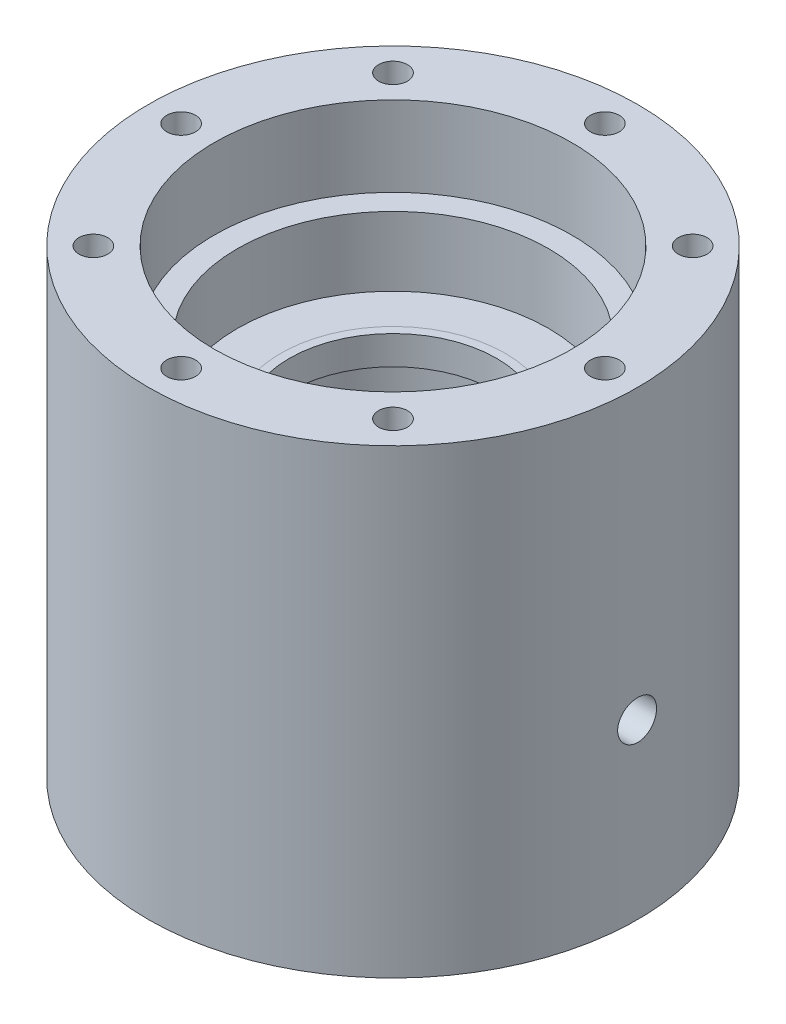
ISO-10303-21;
HEADER;
FILE_DESCRIPTION(('STEP AP214'),'2;1');
FILE_NAME('part.step','',(''),(''),'','','');
FILE_SCHEMA(('AUTOMOTIVE_DESIGN { 1 0 10303 214 1 1 1 1 }'));
ENDSEC;
DATA;
#1=APPLICATION_CONTEXT('core data for automotive mechanical design processes');
#2=APPLICATION_PROTOCOL_DEFINITION('international standard','automotive_design',2000,#1);
#3=PRODUCT_CONTEXT('',#1,'mechanical');
#4=PRODUCT('Part','Part','',(#3));
#5=PRODUCT_RELATED_PRODUCT_CATEGORY('part','',(#4));
#6=PRODUCT_DEFINITION_FORMATION('','',#4);
#7=PRODUCT_DEFINITION_CONTEXT('part definition',#1,'design');
#8=PRODUCT_DEFINITION('design','',#6,#7);
#9=PRODUCT_DEFINITION_SHAPE('','',#8);
#10=(LENGTH_UNIT() NAMED_UNIT(*) SI_UNIT(.MILLI.,.METRE.));
#11=(NAMED_UNIT(*) PLANE_ANGLE_UNIT() SI_UNIT($,.RADIAN.));
#12=(NAMED_UNIT(*) SI_UNIT($,.STERADIAN.) SOLID_ANGLE_UNIT());
#13=UNCERTAINTY_MEASURE_WITH_UNIT(LENGTH_MEASURE(1.E-05),#10,'distance_accuracy_value','');
#14=(GEOMETRIC_REPRESENTATION_CONTEXT(3) GLOBAL_UNCERTAINTY_ASSIGNED_CONTEXT((#13)) GLOBAL_UNIT_ASSIGNED_CONTEXT((#10,
#11,#12)) REPRESENTATION_CONTEXT('',''));
#15=CARTESIAN_POINT('',(0.,0.,0.));
#16=DIRECTION('',(0.,0.,1.));
#17=DIRECTION('',(1.,0.,0.));
#18=AXIS2_PLACEMENT_3D('',#15,#16,#17);
#19=CARTESIAN_POINT('',(0.,49.1,0.));
#20=DIRECTION('',(0.,1.,0.));
#21=DIRECTION('',(0.,0.,1.));
#22=AXIS2_PLACEMENT_3D('',#19,#20,#21);
#23=CYLINDRICAL_SURFACE('',#22,19.5);
#24=CARTESIAN_POINT('',(0.,49.1,0.));
#25=DIRECTION('',(0.,1.,0.));
#26=DIRECTION('',(0.,0.,1.));
#27=AXIS2_PLACEMENT_3D('',#24,#25,#26);
#28=CIRCLE('',#27,19.5);
#29=CARTESIAN_POINT('',(0.,49.1,19.5));
#30=VERTEX_POINT('',#29);
#31=EDGE_CURVE('E11',#30,#30,#28,.T.);
#32=ORIENTED_EDGE('',*,*,#31,.T.);
#33=EDGE_LOOP('',(#32));
#34=FACE_BOUND('',#33,.T.);
#35=CARTESIAN_POINT('',(0.,54.1,0.));
#36=DIRECTION('',(0.,1.,0.));
#37=DIRECTION('',(0.,0.,1.));
#38=AXIS2_PLACEMENT_3D('',#35,#36,#37);
#39=CIRCLE('',#38,19.5);
#40=CARTESIAN_POINT('',(0.,54.1,19.5));
#41=VERTEX_POINT('',#40);
#42=EDGE_CURVE('E44',#41,#41,#39,.T.);
#43=ORIENTED_EDGE('',*,*,#42,.F.);
#44=EDGE_LOOP('',(#43));
#45=FACE_BOUND('',#44,.T.);
#46=ADVANCED_FACE('F41',(#34,#45),#23,.T.);
#47=CARTESIAN_POINT('',(0.,49.1,0.));
#48=DIRECTION('',(0.,1.,0.));
#49=DIRECTION('',(0.,0.,1.));
#50=AXIS2_PLACEMENT_3D('',#47,#48,#49);
#51=PLANE('',#50);
#52=CARTESIAN_POINT('',(0.,49.1,0.));
#53=DIRECTION('',(0.,1.,0.));
#54=DIRECTION('',(0.,0.,1.));
#55=AXIS2_PLACEMENT_3D('',#52,#53,#54);
#56=CIRCLE('',#55,18.);
#57=CARTESIAN_POINT('',(0.,49.1,18.));
#58=VERTEX_POINT('',#57);
#59=EDGE_CURVE('E51',#58,#58,#56,.T.);
#60=ORIENTED_EDGE('',*,*,#59,.T.);
#61=EDGE_LOOP('',(#60));
#62=FACE_BOUND('',#61,.T.);
#63=ORIENTED_EDGE('',*,*,#31,.F.);
#64=EDGE_LOOP('',(#63));
#65=FACE_BOUND('',#64,.T.);
#66=ADVANCED_FACE('F59',(#62,#65),#51,.F.);
#67=CARTESIAN_POINT('',(0.,54.1,0.));
#68=DIRECTION('',(0.,1.,0.));
#69=DIRECTION('',(0.,0.,1.));
#70=AXIS2_PLACEMENT_3D('',#67,#68,#69);
#71=PLANE('',#70);
#72=CARTESIAN_POINT('',(0.,54.1,0.));
#73=DIRECTION('',(0.,1.,0.));
#74=DIRECTION('',(0.,0.,1.));
#75=AXIS2_PLACEMENT_3D('',#72,#73,#74);
#76=CIRCLE('',#75,18.);
#77=CARTESIAN_POINT('',(0.,54.1,18.));
#78=VERTEX_POINT('',#77);
#79=EDGE_CURVE('E53',#78,#78,#76,.T.);
#80=ORIENTED_EDGE('',*,*,#79,.F.);
#81=EDGE_LOOP('',(#80));
#82=FACE_BOUND('',#81,.T.);
#83=ORIENTED_EDGE('',*,*,#42,.T.);
#84=EDGE_LOOP('',(#83));
#85=FACE_BOUND('',#84,.T.);
#86=ADVANCED_FACE('F65',(#82,#85),#71,.T.);
#87=CARTESIAN_POINT('',(0.,49.1,0.));
#88=DIRECTION('',(0.,1.,0.));
#89=DIRECTION('',(0.,0.,1.));
#90=AXIS2_PLACEMENT_3D('',#87,#88,#89);
#91=CYLINDRICAL_SURFACE('',#90,18.);
#92=ORIENTED_EDGE('',*,*,#59,.F.);
#93=EDGE_LOOP('',(#92));
#94=FACE_BOUND('',#93,.T.);
#95=ORIENTED_EDGE('',*,*,#79,.T.);
#96=EDGE_LOOP('',(#95));
#97=FACE_BOUND('',#96,.T.);
#98=ADVANCED_FACE('F62',(#94,#97),#91,.F.);
#99=CLOSED_SHELL('',(#46,#66,#86,#98));
#100=MANIFOLD_SOLID_BREP('B2',#99);
#101=CARTESIAN_POINT('',(0.,80.,0.));
#102=DIRECTION('',(0.,-1.,0.));
#103=DIRECTION('',(0.,0.,-1.));
#104=AXIS2_PLACEMENT_3D('',#101,#102,#103);
#105=CYLINDRICAL_SURFACE('',#104,19.5);
#106=CARTESIAN_POINT('',(19.2057120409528,30.,-3.375));
#107=CARTESIAN_POINT('',(19.2057155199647,30.1880456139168,-3.37499253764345));
#108=CARTESIAN_POINT('',(19.208503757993,30.3761912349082,-3.35923067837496));
#109=CARTESIAN_POINT('',(19.219344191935,30.7471957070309,-3.29663153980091));
#110=CARTESIAN_POINT('',(19.2274011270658,30.930049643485,-3.24976628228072));
#111=CARTESIAN_POINT('',(19.2478397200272,31.2850481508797,-3.12642708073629));
#112=CARTESIAN_POINT('',(19.2602176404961,31.4572018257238,-3.04997871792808));
#113=CARTESIAN_POINT('',(19.2878991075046,31.7862230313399,-2.86970836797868));
#114=CARTESIAN_POINT('',(19.3032023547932,31.9430921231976,-2.76588918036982));
#115=CARTESIAN_POINT('',(19.3351917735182,32.2387739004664,-2.53264832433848));
#116=CARTESIAN_POINT('',(19.3518897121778,32.3774006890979,-2.40299257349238));
#117=CARTESIAN_POINT('',(19.3846827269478,32.631046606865,-2.1222649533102));
#118=CARTESIAN_POINT('',(19.4007777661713,32.7460642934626,-1.97119177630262));
#119=CARTESIAN_POINT('',(19.4306765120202,32.949929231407,-1.65070816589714));
#120=CARTESIAN_POINT('',(19.4444647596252,33.0386027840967,-1.48118567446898));
#121=CARTESIAN_POINT('',(19.4680651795,33.1861451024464,-1.12937245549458));
#122=CARTESIAN_POINT('',(19.4778776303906,33.2450159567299,-0.947082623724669));
#123=CARTESIAN_POINT('',(19.4923377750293,33.3307112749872,-0.576831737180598));
#124=CARTESIAN_POINT('',(19.4970358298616,33.3578484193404,-0.38894505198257));
#125=CARTESIAN_POINT('',(19.5009110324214,33.3802788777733,-0.0112305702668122));
#126=CARTESIAN_POINT('',(19.5000885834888,33.3755745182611,0.178597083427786));
#127=CARTESIAN_POINT('',(19.493055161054,33.3346981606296,0.552665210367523));
#128=CARTESIAN_POINT('',(19.4869018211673,33.2988627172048,0.736943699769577));
#129=CARTESIAN_POINT('',(19.4699623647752,33.1972720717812,1.09683185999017));
#130=CARTESIAN_POINT('',(19.4591760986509,33.1315159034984,1.27244125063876));
#131=CARTESIAN_POINT('',(19.4340851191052,32.9716200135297,1.61099989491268));
#132=CARTESIAN_POINT('',(19.4197634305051,32.8773428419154,1.77388292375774));
#133=CARTESIAN_POINT('',(19.3891906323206,32.6631819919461,2.08164357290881));
#134=CARTESIAN_POINT('',(19.3729393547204,32.5432960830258,2.22651962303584));
#135=CARTESIAN_POINT('',(19.3400617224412,32.279457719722,2.49614399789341));
#136=CARTESIAN_POINT('',(19.3234332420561,32.1352110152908,2.62060429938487));
#137=CARTESIAN_POINT('',(19.2918801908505,31.8277337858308,2.84360364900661));
#138=CARTESIAN_POINT('',(19.2769556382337,31.6645030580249,2.9421424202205));
#139=CARTESIAN_POINT('',(19.2504985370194,31.323343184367,3.11056564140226));
#140=CARTESIAN_POINT('',(19.238970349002,31.1453955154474,3.18041329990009));
#141=CARTESIAN_POINT('',(19.2206816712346,30.7800481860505,3.2891436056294));
#142=CARTESIAN_POINT('',(19.2139207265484,30.5926494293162,3.32802920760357));
#143=CARTESIAN_POINT('',(19.2060206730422,30.2163024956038,3.37332160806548));
#144=CARTESIAN_POINT('',(19.2048103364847,30.0274052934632,3.38013993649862));
#145=CARTESIAN_POINT('',(19.2079585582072,29.6511696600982,3.36220282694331));
#146=CARTESIAN_POINT('',(19.2123168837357,29.4638311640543,3.33744870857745));
#147=CARTESIAN_POINT('',(19.2260453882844,29.097351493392,3.25742098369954));
#148=CARTESIAN_POINT('',(19.235380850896,28.9181627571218,3.20235869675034));
#149=CARTESIAN_POINT('',(19.2579823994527,28.5715555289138,3.06350004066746));
#150=CARTESIAN_POINT('',(19.2712487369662,28.4041377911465,2.97970183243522));
#151=CARTESIAN_POINT('',(19.3003817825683,28.0839988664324,2.78478594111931));
#152=CARTESIAN_POINT('',(19.3162729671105,27.9314398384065,2.67340564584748));
#153=CARTESIAN_POINT('',(19.3487944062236,27.6470293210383,2.4268458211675));
#154=CARTESIAN_POINT('',(19.3654247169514,27.5151794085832,2.29166448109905));
#155=CARTESIAN_POINT('',(19.3977769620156,27.2744168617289,1.99951220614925));
#156=CARTESIAN_POINT('',(19.4134865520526,27.1657793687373,1.84231295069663));
#157=CARTESIAN_POINT('',(19.442026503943,26.9764569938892,1.5116556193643));
#158=CARTESIAN_POINT('',(19.4548569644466,26.8957711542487,1.33819810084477));
#159=CARTESIAN_POINT('',(19.4761395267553,26.7650658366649,0.980748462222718));
#160=CARTESIAN_POINT('',(19.484611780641,26.7149050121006,0.796809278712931));
#161=CARTESIAN_POINT('',(19.4963087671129,26.6462195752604,0.422958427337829));
#162=CARTESIAN_POINT('',(19.4995339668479,26.627692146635,0.233047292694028));
#163=CARTESIAN_POINT('',(19.5003660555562,26.6228855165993,-0.14470608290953));
#164=CARTESIAN_POINT('',(19.4980457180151,26.6361886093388,-0.332542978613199));
#165=CARTESIAN_POINT('',(19.4881967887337,26.693758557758,-0.703263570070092));
#166=CARTESIAN_POINT('',(19.4806682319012,26.7380252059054,-0.886147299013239));
#167=CARTESIAN_POINT('',(19.4612465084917,26.8561006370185,-1.2415924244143));
#168=CARTESIAN_POINT('',(19.4493589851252,26.9298712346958,-1.41416683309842));
#169=CARTESIAN_POINT('',(19.4225137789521,27.1048130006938,-1.74455250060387));
#170=CARTESIAN_POINT('',(19.4075559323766,27.2059856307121,-1.90236297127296));
#171=CARTESIAN_POINT('',(19.3759939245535,27.4343277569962,-2.20083879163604));
#172=CARTESIAN_POINT('',(19.3593717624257,27.5618019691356,-2.34126914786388));
#173=CARTESIAN_POINT('',(19.3264758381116,27.8384910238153,-2.59889233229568));
#174=CARTESIAN_POINT('',(19.3102021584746,27.9877109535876,-2.71607970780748));
#175=CARTESIAN_POINT('',(19.2797099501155,28.3050235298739,-2.92472560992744));
#176=CARTESIAN_POINT('',(19.265508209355,28.4732526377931,-3.01597909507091));
#177=CARTESIAN_POINT('',(19.240967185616,28.8228339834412,-3.16878868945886));
#178=CARTESIAN_POINT('',(19.2306241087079,29.0041731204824,-3.23037398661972));
#179=CARTESIAN_POINT('',(19.2172251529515,29.3218084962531,-3.30897581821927));
#180=CARTESIAN_POINT('',(19.2129322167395,29.4561991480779,-3.33369437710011));
#181=CARTESIAN_POINT('',(19.2071744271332,29.7270423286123,-3.36670900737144));
#182=CARTESIAN_POINT('',(19.2057095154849,29.8634948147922,-3.37500541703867));
#183=CARTESIAN_POINT('',(19.2057120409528,30.,-3.375));
#184=B_SPLINE_CURVE_WITH_KNOTS('',3,(#106,#107,#108,#109,#110,#111,#112,#113,#114,#115,#116,
#117,#118,#119,#120,#121,#122,#123,#124,#125,#126,#127,#128,#129,#130,#131,#132,#133,#134,#135,
#136,#137,#138,#139,#140,#141,#142,#143,#144,#145,#146,#147,#148,#149,#150,#151,#152,#153,#154,
#155,#156,#157,#158,#159,#160,#161,#162,#163,#164,#165,#166,#167,#168,#169,#170,#171,#172,#173,
#174,#175,#176,#177,#178,#179,#180,#181,#182,#183),.UNSPECIFIED.,.T.,.F.,(4,2,2,2,2,2,2,2,2,2,2,
2,2,2,2,2,2,2,2,2,2,2,2,2,2,2,2,2,2,2,2,2,2,2,2,2,2,2,4),(0.,0.563637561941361,1.1277828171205,
1.69144132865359,2.25504221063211,2.82400275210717,3.39299804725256,3.96566571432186,
4.53829324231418,5.10522967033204,5.67212467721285,6.23296625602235,6.79382594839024,
7.35743282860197,7.92108881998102,8.49211663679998,9.06315055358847,9.6349144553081,
10.2066237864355,10.770975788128,11.3353042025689,11.8957468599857,12.4562253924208,
13.0222605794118,13.5883388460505,14.1607944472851,14.7332304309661,15.302995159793,
15.8727091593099,16.4349880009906,16.9972630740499,17.558812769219,18.1203924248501,
18.6888857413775,19.257512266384,19.8305168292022,20.4029565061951,20.8121180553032,
21.2212711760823),.UNSPECIFIED.);
#185=CARTESIAN_POINT('',(19.2057120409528,30.,-3.375));
#186=VERTEX_POINT('',#185);
#187=EDGE_CURVE('E155',#186,#186,#184,.T.);
#188=ORIENTED_EDGE('',*,*,#187,.T.);
#189=EDGE_LOOP('',(#188));
#190=FACE_BOUND('',#189,.T.);
#191=CARTESIAN_POINT('',(0.,0.,0.));
#192=DIRECTION('',(0.,1.,0.));
#193=DIRECTION('',(0.,0.,1.));
#194=AXIS2_PLACEMENT_3D('',#191,#192,#193);
#195=CIRCLE('',#194,19.5);
#196=CARTESIAN_POINT('',(0.,0.,19.5));
#197=VERTEX_POINT('',#196);
#198=EDGE_CURVE('E206',#197,#197,#195,.T.);
#199=ORIENTED_EDGE('',*,*,#198,.F.);
#200=EDGE_LOOP('',(#199));
#201=FACE_BOUND('',#200,.T.);
#202=CARTESIAN_POINT('',(0.,54.1,0.));
#203=DIRECTION('',(0.,1.,0.));
#204=DIRECTION('',(0.,0.,1.));
#205=AXIS2_PLACEMENT_3D('',#202,#203,#204);
#206=CIRCLE('',#205,19.5);
#207=CARTESIAN_POINT('',(0.,54.1,19.5));
#208=VERTEX_POINT('',#207);
#209=EDGE_CURVE('E107',#208,#208,#206,.T.);
#210=ORIENTED_EDGE('',*,*,#209,.T.);
#211=EDGE_LOOP('',(#210));
#212=FACE_BOUND('',#211,.T.);
#213=ADVANCED_FACE('F103',(#190,#201,#212),#105,.F.);
#214=CARTESIAN_POINT('',(0.,80.,0.));
#215=DIRECTION('',(0.,1.,0.));
#216=DIRECTION('',(0.,0.,1.));
#217=AXIS2_PLACEMENT_3D('',#214,#215,#216);
#218=PLANE('',#217);
#219=CARTESIAN_POINT('',(-36.775,80.,0.));
#220=DIRECTION('',(0.,1.,0.));
#221=DIRECTION('',(0.,0.,1.));
#222=AXIS2_PLACEMENT_3D('',#219,#220,#221);
#223=CIRCLE('',#222,2.5);
#224=CARTESIAN_POINT('',(-36.775,80.,2.5));
#225=VERTEX_POINT('',#224);
#226=EDGE_CURVE('E149',#225,#225,#223,.T.);
#227=ORIENTED_EDGE('',*,*,#226,.F.);
#228=EDGE_LOOP('',(#227));
#229=FACE_BOUND('',#228,.T.);
#230=CARTESIAN_POINT('',(0.,80.,-36.775));
#231=DIRECTION('',(0.,1.,0.));
#232=DIRECTION('',(0.,0.,1.));
#233=AXIS2_PLACEMENT_3D('',#230,#231,#232);
#234=CIRCLE('',#233,2.5);
#235=CARTESIAN_POINT('',(0.,80.,-34.275));
#236=VERTEX_POINT('',#235);
#237=EDGE_CURVE('E148',#236,#236,#234,.T.);
#238=ORIENTED_EDGE('',*,*,#237,.F.);
#239=EDGE_LOOP('',(#238));
#240=FACE_BOUND('',#239,.T.);
#241=CARTESIAN_POINT('',(36.775,80.,0.));
#242=DIRECTION('',(0.,1.,0.));
#243=DIRECTION('',(0.,0.,1.));
#244=AXIS2_PLACEMENT_3D('',#241,#242,#243);
#245=CIRCLE('',#244,2.5);
#246=CARTESIAN_POINT('',(36.775,80.,2.5));
#247=VERTEX_POINT('',#246);
#248=EDGE_CURVE('E161',#247,#247,#245,.T.);
#249=ORIENTED_EDGE('',*,*,#248,.F.);
#250=EDGE_LOOP('',(#249));
#251=FACE_BOUND('',#250,.T.);
#252=CARTESIAN_POINT('',(0.,80.,36.775));
#253=DIRECTION('',(0.,1.,0.));
#254=DIRECTION('',(0.,0.,1.));
#255=AXIS2_PLACEMENT_3D('',#252,#253,#254);
#256=CIRCLE('',#255,2.5);
#257=CARTESIAN_POINT('',(0.,80.,39.275));
#258=VERTEX_POINT('',#257);
#259=EDGE_CURVE('E167',#258,#258,#256,.T.);
#260=ORIENTED_EDGE('',*,*,#259,.F.);
#261=EDGE_LOOP('',(#260));
#262=FACE_BOUND('',#261,.T.);
#263=CARTESIAN_POINT('',(-26.0038518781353,80.,-26.0038518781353));
#264=DIRECTION('',(0.,1.,0.));
#265=DIRECTION('',(0.,0.,1.));
#266=AXIS2_PLACEMENT_3D('',#263,#264,#265);
#267=CIRCLE('',#266,2.5);
#268=CARTESIAN_POINT('',(-26.0038518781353,80.,-23.5038518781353));
#269=VERTEX_POINT('',#268);
#270=EDGE_CURVE('E173',#269,#269,#267,.T.);
#271=ORIENTED_EDGE('',*,*,#270,.F.);
#272=EDGE_LOOP('',(#271));
#273=FACE_BOUND('',#272,.T.);
#274=CARTESIAN_POINT('',(26.0038518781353,80.,26.0038518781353));
#275=DIRECTION('',(0.,1.,0.));
#276=DIRECTION('',(0.,0.,1.));
#277=AXIS2_PLACEMENT_3D('',#274,#275,#276);
#278=CIRCLE('',#277,2.5);
#279=CARTESIAN_POINT('',(26.0038518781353,80.,28.5038518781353));
#280=VERTEX_POINT('',#279);
#281=EDGE_CURVE('E179',#280,#280,#278,.T.);
#282=ORIENTED_EDGE('',*,*,#281,.F.);
#283=EDGE_LOOP('',(#282));
#284=FACE_BOUND('',#283,.T.);
#285=CARTESIAN_POINT('',(-26.0038518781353,80.,26.0038518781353));
#286=DIRECTION('',(0.,1.,0.));
#287=DIRECTION('',(0.,0.,1.));
#288=AXIS2_PLACEMENT_3D('',#285,#286,#287);
#289=CIRCLE('',#288,2.5);
#290=CARTESIAN_POINT('',(-26.0038518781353,80.,28.5038518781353));
#291=VERTEX_POINT('',#290);
#292=EDGE_CURVE('E185',#291,#291,#289,.T.);
#293=ORIENTED_EDGE('',*,*,#292,.F.);
#294=EDGE_LOOP('',(#293));
#295=FACE_BOUND('',#294,.T.);
#296=CARTESIAN_POINT('',(26.0038518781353,80.,-26.0038518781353));
#297=DIRECTION('',(0.,1.,0.));
#298=DIRECTION('',(0.,0.,1.));
#299=AXIS2_PLACEMENT_3D('',#296,#297,#298);
#300=CIRCLE('',#299,2.5);
#301=CARTESIAN_POINT('',(26.0038518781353,80.,-23.5038518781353));
#302=VERTEX_POINT('',#301);
#303=EDGE_CURVE('E191',#302,#302,#300,.T.);
#304=ORIENTED_EDGE('',*,*,#303,.F.);
#305=EDGE_LOOP('',(#304));
#306=FACE_BOUND('',#305,.T.);
#307=CARTESIAN_POINT('',(0.,80.,0.));
#308=DIRECTION('',(0.,1.,0.));
#309=DIRECTION('',(0.,0.,1.));
#310=AXIS2_PLACEMENT_3D('',#307,#308,#309);
#311=CIRCLE('',#310,31.05);
#312=CARTESIAN_POINT('',(0.,80.,31.05));
#313=VERTEX_POINT('',#312);
#314=EDGE_CURVE('E207',#313,#313,#311,.T.);
#315=ORIENTED_EDGE('',*,*,#314,.F.);
#316=EDGE_LOOP('',(#315));
#317=FACE_BOUND('',#316,.T.);
#318=CARTESIAN_POINT('',(0.,80.,0.));
#319=DIRECTION('',(0.,1.,0.));
#320=DIRECTION('',(0.,0.,1.));
#321=AXIS2_PLACEMENT_3D('',#318,#319,#320);
#322=CIRCLE('',#321,42.5);
#323=CARTESIAN_POINT('',(0.,80.,42.5));
#324=VERTEX_POINT('',#323);
#325=EDGE_CURVE('E39',#324,#324,#322,.T.);
#326=ORIENTED_EDGE('',*,*,#325,.T.);
#327=EDGE_LOOP('',(#326));
#328=FACE_BOUND('',#327,.T.);
#329=ADVANCED_FACE('F218',(#229,#240,#251,#262,#273,#284,#295,#306,#317,#328),#218,.T.);
#330=CARTESIAN_POINT('',(0.,0.,0.));
#331=DIRECTION('',(0.,1.,0.));
#332=DIRECTION('',(0.,0.,1.));
#333=AXIS2_PLACEMENT_3D('',#330,#331,#332);
#334=PLANE('',#333);
#335=CARTESIAN_POINT('',(0.,0.,0.));
#336=DIRECTION('',(0.,1.,0.));
#337=DIRECTION('',(0.,0.,1.));
#338=AXIS2_PLACEMENT_3D('',#335,#336,#337);
#339=CIRCLE('',#338,42.5);
#340=CARTESIAN_POINT('',(0.,0.,42.5));
#341=VERTEX_POINT('',#340);
#342=EDGE_CURVE('E112',#341,#341,#339,.T.);
#343=ORIENTED_EDGE('',*,*,#342,.F.);
#344=EDGE_LOOP('',(#343));
#345=FACE_BOUND('',#344,.T.);
#346=ORIENTED_EDGE('',*,*,#198,.T.);
#347=EDGE_LOOP('',(#346));
#348=FACE_BOUND('',#347,.T.);
#349=ADVANCED_FACE('F215',(#345,#348),#334,.F.);
#350=CARTESIAN_POINT('',(0.,80.,0.));
#351=DIRECTION('',(0.,-1.,0.));
#352=DIRECTION('',(0.,0.,-1.));
#353=AXIS2_PLACEMENT_3D('',#350,#351,#352);
#354=CYLINDRICAL_SURFACE('',#353,42.5);
#355=CARTESIAN_POINT('',(42.3657807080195,30.,-3.375));
#356=CARTESIAN_POINT('',(42.3657824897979,30.1892542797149,-3.37499171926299));
#357=CARTESIAN_POINT('',(42.3670624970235,30.3786381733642,-3.35902771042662));
#358=CARTESIAN_POINT('',(42.3720443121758,30.7521681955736,-3.29557799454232));
#359=CARTESIAN_POINT('',(42.3757488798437,30.9363081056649,-3.24805636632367));
#360=CARTESIAN_POINT('',(42.3851575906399,31.2938859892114,-3.12287247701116));
#361=CARTESIAN_POINT('',(42.3908606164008,31.4673298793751,-3.04522705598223));
#362=CARTESIAN_POINT('',(42.4036222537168,31.7986807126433,-2.86202905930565));
#363=CARTESIAN_POINT('',(42.4106805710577,31.9565910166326,-2.7564825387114));
#364=CARTESIAN_POINT('',(42.4253760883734,32.2528044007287,-2.52021058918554));
#365=CARTESIAN_POINT('',(42.4330144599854,32.3910660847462,-2.3894333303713));
#366=CARTESIAN_POINT('',(42.4479986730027,32.6437020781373,-2.10652146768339));
#367=CARTESIAN_POINT('',(42.4553445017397,32.7580753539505,-1.95438594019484));
#368=CARTESIAN_POINT('',(42.4689268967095,32.9598239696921,-1.63283127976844));
#369=CARTESIAN_POINT('',(42.4751619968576,33.0471637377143,-1.4633897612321));
#370=CARTESIAN_POINT('',(42.4858078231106,33.1921385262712,-1.11218925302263));
#371=CARTESIAN_POINT('',(42.4902185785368,33.2497740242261,-0.930430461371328));
#372=CARTESIAN_POINT('',(42.4967105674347,33.333585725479,-0.560164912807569));
#373=CARTESIAN_POINT('',(42.49879673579,33.3598285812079,-0.371673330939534));
#374=CARTESIAN_POINT('',(42.5004212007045,33.3803160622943,0.00704998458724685));
#375=CARTESIAN_POINT('',(42.4999595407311,33.3745612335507,0.19728168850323));
#376=CARTESIAN_POINT('',(42.4965444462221,33.3312713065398,0.573633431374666));
#377=CARTESIAN_POINT('',(42.4935966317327,33.2938078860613,0.759761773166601));
#378=CARTESIAN_POINT('',(42.485547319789,33.1882756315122,1.1230800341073));
#379=CARTESIAN_POINT('',(42.4804458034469,33.12020652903,1.3002698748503));
#380=CARTESIAN_POINT('',(42.4686534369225,32.9553149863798,1.64090988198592));
#381=CARTESIAN_POINT('',(42.4619608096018,32.8584603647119,1.80434440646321));
#382=CARTESIAN_POINT('',(42.4477385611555,32.6387705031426,2.1126637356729));
#383=CARTESIAN_POINT('',(42.4402089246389,32.5159347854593,2.25754819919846));
#384=CARTESIAN_POINT('',(42.4251345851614,32.2473654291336,2.52507360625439));
#385=CARTESIAN_POINT('',(42.4175898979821,32.1015695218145,2.64765204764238));
#386=CARTESIAN_POINT('',(42.4033567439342,31.791435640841,2.86660318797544));
#387=CARTESIAN_POINT('',(42.3966682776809,31.6270976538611,2.96297586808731));
#388=CARTESIAN_POINT('',(42.3849034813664,31.2845015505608,3.12677700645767));
#389=CARTESIAN_POINT('',(42.3798273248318,31.1062419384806,3.19420234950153));
#390=CARTESIAN_POINT('',(42.3718651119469,30.7408830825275,3.29814923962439));
#391=CARTESIAN_POINT('',(42.3689790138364,30.5537840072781,3.33467137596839));
#392=CARTESIAN_POINT('',(42.3657303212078,30.1766038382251,3.3756962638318));
#393=CARTESIAN_POINT('',(42.3653608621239,29.9865322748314,3.38028611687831));
#394=CARTESIAN_POINT('',(42.3671691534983,29.6083223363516,3.3575441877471));
#395=CARTESIAN_POINT('',(42.3693468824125,29.4201839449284,3.33021267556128));
#396=CARTESIAN_POINT('',(42.3759979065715,29.0514301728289,3.24447641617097));
#397=CARTESIAN_POINT('',(42.3804682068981,28.8708053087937,3.18611220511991));
#398=CARTESIAN_POINT('',(42.3911981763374,28.5219123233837,3.04000846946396));
#399=CARTESIAN_POINT('',(42.3974578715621,28.3536443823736,2.9522685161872));
#400=CARTESIAN_POINT('',(42.4110779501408,28.0338428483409,2.74968304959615));
#401=CARTESIAN_POINT('',(42.418440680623,27.8823461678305,2.63477942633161));
#402=CARTESIAN_POINT('',(42.4334292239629,27.6007603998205,2.3812123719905));
#403=CARTESIAN_POINT('',(42.4410550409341,27.4706716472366,2.24254856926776));
#404=CARTESIAN_POINT('',(42.4557308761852,27.2352978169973,1.94502123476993));
#405=CARTESIAN_POINT('',(42.4627795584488,27.1300692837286,1.78611289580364));
#406=CARTESIAN_POINT('',(42.4754876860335,26.9477906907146,1.45283099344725));
#407=CARTESIAN_POINT('',(42.4811471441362,26.8707403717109,1.27845757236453));
#408=CARTESIAN_POINT('',(42.4904329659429,26.7471027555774,0.919399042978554));
#409=CARTESIAN_POINT('',(42.4940616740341,26.7004803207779,0.734726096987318));
#410=CARTESIAN_POINT('',(42.4988866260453,26.6389070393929,0.360143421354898));
#411=CARTESIAN_POINT('',(42.5000829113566,26.6239556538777,0.170233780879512));
#412=CARTESIAN_POINT('',(42.4999083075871,26.6261549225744,-0.208873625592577));
#413=CARTESIAN_POINT('',(42.4985444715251,26.643217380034,-0.398071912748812));
#414=CARTESIAN_POINT('',(42.4934168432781,26.7087762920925,-0.770907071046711));
#415=CARTESIAN_POINT('',(42.4896530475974,26.7572727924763,-0.95454393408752));
#416=CARTESIAN_POINT('',(42.4801479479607,26.8843012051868,-1.31105063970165));
#417=CARTESIAN_POINT('',(42.4744067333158,26.962831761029,-1.48392096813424));
#418=CARTESIAN_POINT('',(42.4615895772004,27.1476886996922,-1.81403760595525));
#419=CARTESIAN_POINT('',(42.4545136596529,27.2540145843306,-1.97128419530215));
#420=CARTESIAN_POINT('',(42.4397984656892,27.4917746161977,-2.26614062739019));
#421=CARTESIAN_POINT('',(42.4321577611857,27.6232738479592,-2.40369791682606));
#422=CARTESIAN_POINT('',(42.4171862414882,27.9075340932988,-2.65484162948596));
#423=CARTESIAN_POINT('',(42.4098555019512,28.0603002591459,-2.76842222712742));
#424=CARTESIAN_POINT('',(42.3963200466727,28.3830283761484,-2.96852722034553));
#425=CARTESIAN_POINT('',(42.390117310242,28.5530197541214,-3.05500424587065));
#426=CARTESIAN_POINT('',(42.3795644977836,28.9050412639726,-3.19807870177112));
#427=CARTESIAN_POINT('',(42.3752122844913,29.0870572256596,-3.25471062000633));
#428=CARTESIAN_POINT('',(42.3699770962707,29.3917963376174,-3.32200144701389));
#429=CARTESIAN_POINT('',(42.3684106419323,29.5125573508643,-3.34184963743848));
#430=CARTESIAN_POINT('',(42.366311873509,29.7555275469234,-3.36835157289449));
#431=CARTESIAN_POINT('',(42.3657795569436,29.8777367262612,-3.37500534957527));
#432=CARTESIAN_POINT('',(42.3657807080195,30.,-3.375));
#433=B_SPLINE_CURVE_WITH_KNOTS('',3,(#355,#356,#357,#358,#359,#360,#361,#362,#363,#364,#365,
#366,#367,#368,#369,#370,#371,#372,#373,#374,#375,#376,#377,#378,#379,#380,#381,#382,#383,#384,
#385,#386,#387,#388,#389,#390,#391,#392,#393,#394,#395,#396,#397,#398,#399,#400,#401,#402,#403,
#404,#405,#406,#407,#408,#409,#410,#411,#412,#413,#414,#415,#416,#417,#418,#419,#420,#421,#422,
#423,#424,#425,#426,#427,#428,#429,#430,#431,#432),.UNSPECIFIED.,.T.,.F.,(4,2,2,2,2,2,2,2,2,2,2,
2,2,2,2,2,2,2,2,2,2,2,2,2,2,2,2,2,2,2,2,2,2,2,2,2,2,2,4),(0.,0.567316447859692,1.13527976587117,
1.70292603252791,2.27044921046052,2.83915087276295,3.40787713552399,3.97734860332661,
4.5468109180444,5.11506199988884,5.6833033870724,6.25026367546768,6.81722893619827,
7.38483044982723,7.95244240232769,8.52162112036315,9.09080024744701,9.66004061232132,
10.229270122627,10.7969463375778,11.3646177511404,11.9315494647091,12.4984894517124,
13.0666534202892,13.6348262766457,14.2042792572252,14.7737269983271,15.3425159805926,
15.911295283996,16.4785099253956,17.045725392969,17.6129152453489,18.18009493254,
18.7487613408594,19.3175657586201,19.8873588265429,20.4564920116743,20.8229943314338,
21.1894957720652),.UNSPECIFIED.);
#434=CARTESIAN_POINT('',(42.3657807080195,30.,-3.375));
#435=VERTEX_POINT('',#434);
#436=EDGE_CURVE('E265',#435,#435,#433,.T.);
#437=ORIENTED_EDGE('',*,*,#436,.F.);
#438=EDGE_LOOP('',(#437));
#439=FACE_BOUND('',#438,.T.);
#440=ORIENTED_EDGE('',*,*,#325,.F.);
#441=EDGE_LOOP('',(#440));
#442=FACE_BOUND('',#441,.T.);
#443=ORIENTED_EDGE('',*,*,#342,.T.);
#444=EDGE_LOOP('',(#443));
#445=FACE_BOUND('',#444,.T.);
#446=ADVANCED_FACE('F105',(#439,#442,#445),#354,.T.);
#447=CARTESIAN_POINT('',(0.,66.1,0.));
#448=DIRECTION('',(0.,1.,0.));
#449=DIRECTION('',(0.,0.,1.));
#450=AXIS2_PLACEMENT_3D('',#447,#448,#449);
#451=CYLINDRICAL_SURFACE('',#450,31.05);
#452=CARTESIAN_POINT('',(0.,66.1,0.));
#453=DIRECTION('',(0.,1.,0.));
#454=DIRECTION('',(0.,0.,1.));
#455=AXIS2_PLACEMENT_3D('',#452,#453,#454);
#456=CIRCLE('',#455,31.05);
#457=CARTESIAN_POINT('',(0.,66.1,31.05));
#458=VERTEX_POINT('',#457);
#459=EDGE_CURVE('E203',#458,#458,#456,.T.);
#460=ORIENTED_EDGE('',*,*,#459,.F.);
#461=EDGE_LOOP('',(#460));
#462=FACE_BOUND('',#461,.T.);
#463=ORIENTED_EDGE('',*,*,#314,.T.);
#464=EDGE_LOOP('',(#463));
#465=FACE_BOUND('',#464,.T.);
#466=ADVANCED_FACE('F244',(#462,#465),#451,.F.);
#467=CARTESIAN_POINT('',(0.,66.1,0.));
#468=DIRECTION('',(0.,1.,0.));
#469=DIRECTION('',(0.,0.,1.));
#470=AXIS2_PLACEMENT_3D('',#467,#468,#469);
#471=PLANE('',#470);
#472=CARTESIAN_POINT('',(0.,66.1,0.));
#473=DIRECTION('',(0.,1.,0.));
#474=DIRECTION('',(0.,0.,1.));
#475=AXIS2_PLACEMENT_3D('',#472,#473,#474);
#476=CIRCLE('',#475,27.);
#477=CARTESIAN_POINT('',(0.,66.1,27.));
#478=VERTEX_POINT('',#477);
#479=EDGE_CURVE('E197',#478,#478,#476,.T.);
#480=ORIENTED_EDGE('',*,*,#479,.F.);
#481=EDGE_LOOP('',(#480));
#482=FACE_BOUND('',#481,.T.);
#483=ORIENTED_EDGE('',*,*,#459,.T.);
#484=EDGE_LOOP('',(#483));
#485=FACE_BOUND('',#484,.T.);
#486=ADVANCED_FACE('F238',(#482,#485),#471,.T.);
#487=CARTESIAN_POINT('',(0.,54.1,0.));
#488=DIRECTION('',(0.,1.,0.));
#489=DIRECTION('',(0.,0.,1.));
#490=AXIS2_PLACEMENT_3D('',#487,#488,#489);
#491=CYLINDRICAL_SURFACE('',#490,27.);
#492=CARTESIAN_POINT('',(0.,54.1,0.));
#493=DIRECTION('',(0.,1.,0.));
#494=DIRECTION('',(0.,0.,1.));
#495=AXIS2_PLACEMENT_3D('',#492,#493,#494);
#496=CIRCLE('',#495,27.);
#497=CARTESIAN_POINT('',(0.,54.1,27.));
#498=VERTEX_POINT('',#497);
#499=EDGE_CURVE('E198',#498,#498,#496,.T.);
#500=ORIENTED_EDGE('',*,*,#499,.F.);
#501=EDGE_LOOP('',(#500));
#502=FACE_BOUND('',#501,.T.);
#503=ORIENTED_EDGE('',*,*,#479,.T.);
#504=EDGE_LOOP('',(#503));
#505=FACE_BOUND('',#504,.T.);
#506=ADVANCED_FACE('F232',(#502,#505),#491,.F.);
#507=CARTESIAN_POINT('',(0.,54.1,0.));
#508=DIRECTION('',(0.,1.,0.));
#509=DIRECTION('',(0.,0.,1.));
#510=AXIS2_PLACEMENT_3D('',#507,#508,#509);
#511=PLANE('',#510);
#512=ORIENTED_EDGE('',*,*,#209,.F.);
#513=EDGE_LOOP('',(#512));
#514=FACE_BOUND('',#513,.T.);
#515=ORIENTED_EDGE('',*,*,#499,.T.);
#516=EDGE_LOOP('',(#515));
#517=FACE_BOUND('',#516,.T.);
#518=ADVANCED_FACE('F228',(#514,#517),#511,.T.);
#519=CARTESIAN_POINT('',(26.0038518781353,68.,-26.0038518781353));
#520=DIRECTION('',(0.,1.,0.));
#521=DIRECTION('',(0.,0.,1.));
#522=AXIS2_PLACEMENT_3D('',#519,#520,#521);
#523=CONICAL_SURFACE('',#522,2.5,1.02974425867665);
#524=CARTESIAN_POINT('',(26.0038518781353,66.4978484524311,-26.0038518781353));
#525=VERTEX_POINT('',#524);
#526=VERTEX_LOOP('',#525);
#527=FACE_BOUND('',#526,.T.);
#528=CARTESIAN_POINT('',(26.0038518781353,68.,-26.0038518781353));
#529=DIRECTION('',(0.,1.,0.));
#530=DIRECTION('',(0.,0.,1.));
#531=AXIS2_PLACEMENT_3D('',#528,#529,#530);
#532=CIRCLE('',#531,2.5);
#533=CARTESIAN_POINT('',(26.0038518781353,68.,-23.5038518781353));
#534=VERTEX_POINT('',#533);
#535=EDGE_CURVE('E194',#534,#534,#532,.T.);
#536=ORIENTED_EDGE('',*,*,#535,.T.);
#537=EDGE_LOOP('',(#536));
#538=FACE_BOUND('',#537,.T.);
#539=ADVANCED_FACE('F231',(#527,#538),#523,.F.);
#540=CARTESIAN_POINT('',(26.0038518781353,80.,-26.0038518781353));
#541=DIRECTION('',(0.,1.,0.));
#542=DIRECTION('',(0.,0.,1.));
#543=AXIS2_PLACEMENT_3D('',#540,#541,#542);
#544=CYLINDRICAL_SURFACE('',#543,2.5);
#545=ORIENTED_EDGE('',*,*,#535,.F.);
#546=EDGE_LOOP('',(#545));
#547=FACE_BOUND('',#546,.T.);
#548=ORIENTED_EDGE('',*,*,#303,.T.);
#549=EDGE_LOOP('',(#548));
#550=FACE_BOUND('',#549,.T.);
#551=ADVANCED_FACE('F334',(#547,#550),#544,.F.);
#552=CARTESIAN_POINT('',(-26.0038518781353,68.,26.0038518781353));
#553=DIRECTION('',(0.,1.,0.));
#554=DIRECTION('',(0.,0.,1.));
#555=AXIS2_PLACEMENT_3D('',#552,#553,#554);
#556=CONICAL_SURFACE('',#555,2.5,1.02974425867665);
#557=CARTESIAN_POINT('',(-26.0038518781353,66.4978484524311,26.0038518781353));
#558=VERTEX_POINT('',#557);
#559=VERTEX_LOOP('',#558);
#560=FACE_BOUND('',#559,.T.);
#561=CARTESIAN_POINT('',(-26.0038518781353,68.,26.0038518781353));
#562=DIRECTION('',(0.,1.,0.));
#563=DIRECTION('',(0.,0.,1.));
#564=AXIS2_PLACEMENT_3D('',#561,#562,#563);
#565=CIRCLE('',#564,2.5);
#566=CARTESIAN_POINT('',(-26.0038518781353,68.,28.5038518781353));
#567=VERTEX_POINT('',#566);
#568=EDGE_CURVE('E188',#567,#567,#565,.T.);
#569=ORIENTED_EDGE('',*,*,#568,.T.);
#570=EDGE_LOOP('',(#569));
#571=FACE_BOUND('',#570,.T.);
#572=ADVANCED_FACE('F330',(#560,#571),#556,.F.);
#573=CARTESIAN_POINT('',(-26.0038518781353,80.,26.0038518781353));
#574=DIRECTION('',(0.,1.,0.));
#575=DIRECTION('',(0.,0.,1.));
#576=AXIS2_PLACEMENT_3D('',#573,#574,#575);
#577=CYLINDRICAL_SURFACE('',#576,2.5);
#578=ORIENTED_EDGE('',*,*,#568,.F.);
#579=EDGE_LOOP('',(#578));
#580=FACE_BOUND('',#579,.T.);
#581=ORIENTED_EDGE('',*,*,#292,.T.);
#582=EDGE_LOOP('',(#581));
#583=FACE_BOUND('',#582,.T.);
#584=ADVANCED_FACE('F326',(#580,#583),#577,.F.);
#585=CARTESIAN_POINT('',(26.0038518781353,68.,26.0038518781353));
#586=DIRECTION('',(0.,1.,0.));
#587=DIRECTION('',(0.,0.,1.));
#588=AXIS2_PLACEMENT_3D('',#585,#586,#587);
#589=CONICAL_SURFACE('',#588,2.5,1.02974425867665);
#590=CARTESIAN_POINT('',(26.0038518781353,66.4978484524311,26.0038518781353));
#591=VERTEX_POINT('',#590);
#592=VERTEX_LOOP('',#591);
#593=FACE_BOUND('',#592,.T.);
#594=CARTESIAN_POINT('',(26.0038518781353,68.,26.0038518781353));
#595=DIRECTION('',(0.,1.,0.));
#596=DIRECTION('',(0.,0.,1.));
#597=AXIS2_PLACEMENT_3D('',#594,#595,#596);
#598=CIRCLE('',#597,2.5);
#599=CARTESIAN_POINT('',(26.0038518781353,68.,28.5038518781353));
#600=VERTEX_POINT('',#599);
#601=EDGE_CURVE('E182',#600,#600,#598,.T.);
#602=ORIENTED_EDGE('',*,*,#601,.T.);
#603=EDGE_LOOP('',(#602));
#604=FACE_BOUND('',#603,.T.);
#605=ADVANCED_FACE('F322',(#593,#604),#589,.F.);
#606=CARTESIAN_POINT('',(26.0038518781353,80.,26.0038518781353));
#607=DIRECTION('',(0.,1.,0.));
#608=DIRECTION('',(0.,0.,1.));
#609=AXIS2_PLACEMENT_3D('',#606,#607,#608);
#610=CYLINDRICAL_SURFACE('',#609,2.5);
#611=ORIENTED_EDGE('',*,*,#601,.F.);
#612=EDGE_LOOP('',(#611));
#613=FACE_BOUND('',#612,.T.);
#614=ORIENTED_EDGE('',*,*,#281,.T.);
#615=EDGE_LOOP('',(#614));
#616=FACE_BOUND('',#615,.T.);
#617=ADVANCED_FACE('F318',(#613,#616),#610,.F.);
#618=CARTESIAN_POINT('',(-26.0038518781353,68.,-26.0038518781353));
#619=DIRECTION('',(0.,1.,0.));
#620=DIRECTION('',(0.,0.,1.));
#621=AXIS2_PLACEMENT_3D('',#618,#619,#620);
#622=CONICAL_SURFACE('',#621,2.5,1.02974425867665);
#623=CARTESIAN_POINT('',(-26.0038518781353,66.4978484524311,-26.0038518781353));
#624=VERTEX_POINT('',#623);
#625=VERTEX_LOOP('',#624);
#626=FACE_BOUND('',#625,.T.);
#627=CARTESIAN_POINT('',(-26.0038518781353,68.,-26.0038518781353));
#628=DIRECTION('',(0.,1.,0.));
#629=DIRECTION('',(0.,0.,1.));
#630=AXIS2_PLACEMENT_3D('',#627,#628,#629);
#631=CIRCLE('',#630,2.5);
#632=CARTESIAN_POINT('',(-26.0038518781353,68.,-23.5038518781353));
#633=VERTEX_POINT('',#632);
#634=EDGE_CURVE('E176',#633,#633,#631,.T.);
#635=ORIENTED_EDGE('',*,*,#634,.T.);
#636=EDGE_LOOP('',(#635));
#637=FACE_BOUND('',#636,.T.);
#638=ADVANCED_FACE('F314',(#626,#637),#622,.F.);
#639=CARTESIAN_POINT('',(-26.0038518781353,80.,-26.0038518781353));
#640=DIRECTION('',(0.,1.,0.));
#641=DIRECTION('',(0.,0.,1.));
#642=AXIS2_PLACEMENT_3D('',#639,#640,#641);
#643=CYLINDRICAL_SURFACE('',#642,2.5);
#644=ORIENTED_EDGE('',*,*,#634,.F.);
#645=EDGE_LOOP('',(#644));
#646=FACE_BOUND('',#645,.T.);
#647=ORIENTED_EDGE('',*,*,#270,.T.);
#648=EDGE_LOOP('',(#647));
#649=FACE_BOUND('',#648,.T.);
#650=ADVANCED_FACE('F310',(#646,#649),#643,.F.);
#651=CARTESIAN_POINT('',(0.,68.,36.775));
#652=DIRECTION('',(0.,1.,0.));
#653=DIRECTION('',(0.,0.,1.));
#654=AXIS2_PLACEMENT_3D('',#651,#652,#653);
#655=CONICAL_SURFACE('',#654,2.5,1.02974425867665);
#656=CARTESIAN_POINT('',(0.,66.4978484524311,36.775));
#657=VERTEX_POINT('',#656);
#658=VERTEX_LOOP('',#657);
#659=FACE_BOUND('',#658,.T.);
#660=CARTESIAN_POINT('',(0.,68.,36.775));
#661=DIRECTION('',(0.,1.,0.));
#662=DIRECTION('',(0.,0.,1.));
#663=AXIS2_PLACEMENT_3D('',#660,#661,#662);
#664=CIRCLE('',#663,2.5);
#665=CARTESIAN_POINT('',(0.,68.,39.275));
#666=VERTEX_POINT('',#665);
#667=EDGE_CURVE('E170',#666,#666,#664,.T.);
#668=ORIENTED_EDGE('',*,*,#667,.T.);
#669=EDGE_LOOP('',(#668));
#670=FACE_BOUND('',#669,.T.);
#671=ADVANCED_FACE('F306',(#659,#670),#655,.F.);
#672=CARTESIAN_POINT('',(0.,80.,36.775));
#673=DIRECTION('',(0.,1.,0.));
#674=DIRECTION('',(0.,0.,1.));
#675=AXIS2_PLACEMENT_3D('',#672,#673,#674);
#676=CYLINDRICAL_SURFACE('',#675,2.5);
#677=ORIENTED_EDGE('',*,*,#667,.F.);
#678=EDGE_LOOP('',(#677));
#679=FACE_BOUND('',#678,.T.);
#680=ORIENTED_EDGE('',*,*,#259,.T.);
#681=EDGE_LOOP('',(#680));
#682=FACE_BOUND('',#681,.T.);
#683=ADVANCED_FACE('F302',(#679,#682),#676,.F.);
#684=CARTESIAN_POINT('',(36.775,68.,0.));
#685=DIRECTION('',(0.,1.,0.));
#686=DIRECTION('',(0.,0.,1.));
#687=AXIS2_PLACEMENT_3D('',#684,#685,#686);
#688=CONICAL_SURFACE('',#687,2.5,1.02974425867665);
#689=CARTESIAN_POINT('',(36.775,66.4978484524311,0.));
#690=VERTEX_POINT('',#689);
#691=VERTEX_LOOP('',#690);
#692=FACE_BOUND('',#691,.T.);
#693=CARTESIAN_POINT('',(36.775,68.,0.));
#694=DIRECTION('',(0.,1.,0.));
#695=DIRECTION('',(0.,0.,1.));
#696=AXIS2_PLACEMENT_3D('',#693,#694,#695);
#697=CIRCLE('',#696,2.5);
#698=CARTESIAN_POINT('',(36.775,68.,2.5));
#699=VERTEX_POINT('',#698);
#700=EDGE_CURVE('E164',#699,#699,#697,.T.);
#701=ORIENTED_EDGE('',*,*,#700,.T.);
#702=EDGE_LOOP('',(#701));
#703=FACE_BOUND('',#702,.T.);
#704=ADVANCED_FACE('F298',(#692,#703),#688,.F.);
#705=CARTESIAN_POINT('',(36.775,80.,0.));
#706=DIRECTION('',(0.,1.,0.));
#707=DIRECTION('',(0.,0.,1.));
#708=AXIS2_PLACEMENT_3D('',#705,#706,#707);
#709=CYLINDRICAL_SURFACE('',#708,2.5);
#710=ORIENTED_EDGE('',*,*,#700,.F.);
#711=EDGE_LOOP('',(#710));
#712=FACE_BOUND('',#711,.T.);
#713=ORIENTED_EDGE('',*,*,#248,.T.);
#714=EDGE_LOOP('',(#713));
#715=FACE_BOUND('',#714,.T.);
#716=ADVANCED_FACE('F294',(#712,#715),#709,.F.);
#717=CARTESIAN_POINT('',(0.,68.,-36.775));
#718=DIRECTION('',(0.,1.,0.));
#719=DIRECTION('',(0.,0.,1.));
#720=AXIS2_PLACEMENT_3D('',#717,#718,#719);
#721=CONICAL_SURFACE('',#720,2.5,1.02974425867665);
#722=CARTESIAN_POINT('',(0.,66.4978484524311,-36.775));
#723=VERTEX_POINT('',#722);
#724=VERTEX_LOOP('',#723);
#725=FACE_BOUND('',#724,.T.);
#726=CARTESIAN_POINT('',(0.,68.,-36.775));
#727=DIRECTION('',(0.,1.,0.));
#728=DIRECTION('',(0.,0.,1.));
#729=AXIS2_PLACEMENT_3D('',#726,#727,#728);
#730=CIRCLE('',#729,2.5);
#731=CARTESIAN_POINT('',(0.,68.,-34.275));
#732=VERTEX_POINT('',#731);
#733=EDGE_CURVE('E152',#732,#732,#730,.T.);
#734=ORIENTED_EDGE('',*,*,#733,.T.);
#735=EDGE_LOOP('',(#734));
#736=FACE_BOUND('',#735,.T.);
#737=ADVANCED_FACE('F290',(#725,#736),#721,.F.);
#738=CARTESIAN_POINT('',(0.,80.,-36.775));
#739=DIRECTION('',(0.,1.,0.));
#740=DIRECTION('',(0.,0.,1.));
#741=AXIS2_PLACEMENT_3D('',#738,#739,#740);
#742=CYLINDRICAL_SURFACE('',#741,2.5);
#743=ORIENTED_EDGE('',*,*,#733,.F.);
#744=EDGE_LOOP('',(#743));
#745=FACE_BOUND('',#744,.T.);
#746=ORIENTED_EDGE('',*,*,#237,.T.);
#747=EDGE_LOOP('',(#746));
#748=FACE_BOUND('',#747,.T.);
#749=ADVANCED_FACE('F142',(#745,#748),#742,.F.);
#750=CARTESIAN_POINT('',(-36.775,68.,0.));
#751=DIRECTION('',(0.,1.,0.));
#752=DIRECTION('',(0.,0.,1.));
#753=AXIS2_PLACEMENT_3D('',#750,#751,#752);
#754=CONICAL_SURFACE('',#753,2.5,1.02974425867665);
#755=CARTESIAN_POINT('',(-36.775,66.4978484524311,0.));
#756=VERTEX_POINT('',#755);
#757=VERTEX_LOOP('',#756);
#758=FACE_BOUND('',#757,.T.);
#759=CARTESIAN_POINT('',(-36.775,68.,0.));
#760=DIRECTION('',(0.,1.,0.));
#761=DIRECTION('',(0.,0.,1.));
#762=AXIS2_PLACEMENT_3D('',#759,#760,#761);
#763=CIRCLE('',#762,2.5);
#764=CARTESIAN_POINT('',(-36.775,68.,2.5));
#765=VERTEX_POINT('',#764);
#766=EDGE_CURVE('E146',#765,#765,#763,.T.);
#767=ORIENTED_EDGE('',*,*,#766,.T.);
#768=EDGE_LOOP('',(#767));
#769=FACE_BOUND('',#768,.T.);
#770=ADVANCED_FACE('F138',(#758,#769),#754,.F.);
#771=CARTESIAN_POINT('',(-36.775,80.,0.));
#772=DIRECTION('',(0.,1.,0.));
#773=DIRECTION('',(0.,0.,1.));
#774=AXIS2_PLACEMENT_3D('',#771,#772,#773);
#775=CYLINDRICAL_SURFACE('',#774,2.5);
#776=ORIENTED_EDGE('',*,*,#766,.F.);
#777=EDGE_LOOP('',(#776));
#778=FACE_BOUND('',#777,.T.);
#779=ORIENTED_EDGE('',*,*,#226,.T.);
#780=EDGE_LOOP('',(#779));
#781=FACE_BOUND('',#780,.T.);
#782=ADVANCED_FACE('F141',(#778,#781),#775,.F.);
#783=CARTESIAN_POINT('',(-42.501,30.,0.));
#784=DIRECTION('',(1.,0.,0.));
#785=DIRECTION('',(0.,0.,-1.));
#786=AXIS2_PLACEMENT_3D('',#783,#784,#785);
#787=CYLINDRICAL_SURFACE('',#786,3.375);
#788=ORIENTED_EDGE('',*,*,#187,.F.);
#789=EDGE_LOOP('',(#788));
#790=FACE_BOUND('',#789,.T.);
#791=ORIENTED_EDGE('',*,*,#436,.T.);
#792=EDGE_LOOP('',(#791));
#793=FACE_BOUND('',#792,.T.);
#794=ADVANCED_FACE('F278',(#790,#793),#787,.F.);
#795=CLOSED_SHELL('',(#213,#329,#349,#446,#466,#486,#506,#518,#539,#551,#572,#584,#605,#617,
#638,#650,#671,#683,#704,#716,#737,#749,#770,#782,#794));
#796=MANIFOLD_SOLID_BREP('B6',#795);
#797=ADVANCED_BREP_SHAPE_REPRESENTATION('',(#18,#100,#796),#14);
#798=SHAPE_DEFINITION_REPRESENTATION(#9,#797);
ENDSEC;
END-ISO-10303-21;
